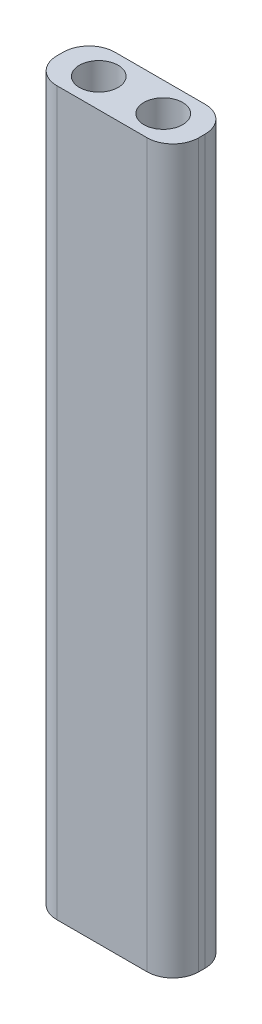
from build123d import *

# Parameters (mm, degrees)
SKETCH1_W           = 11
SKETCH1_H           = 4.5
SKETCH1_R           = 1.5
BOSS_EXTRUDE1_DEPTH = 56
FILLET1_R           = 2


with BuildPart() as part:
    # Sketch1 → Boss-Extrude1 (new body)
    with BuildSketch(Plane(origin=(0, 0, 0), x_dir=(1, 0, 0), z_dir=(0, 1, 0))):
        Rectangle(SKETCH1_W, SKETCH1_H)
        with Locations(Location((-2.5, 0, 0), (0, 0, 270))):
            Circle(SKETCH1_R, mode=Mode.SUBTRACT)
        with Locations(Location((2.5, 0, 0), (0, 0, 270))):
            Circle(SKETCH1_R, mode=Mode.SUBTRACT)
    extrude(amount=BOSS_EXTRUDE1_DEPTH)

    # Fillet1
    fillet1_edges = [part.edges().sort_by_distance(p)[0] for p in [
        (-5.5, 28, 2.25),
        (-5.5, 28, -2.25),
        (5.5, 28, -2.25),
        (5.5, 28, 2.25),
    ]]
    fillet(fillet1_edges, radius=FILLET1_R)


solid = part.part
